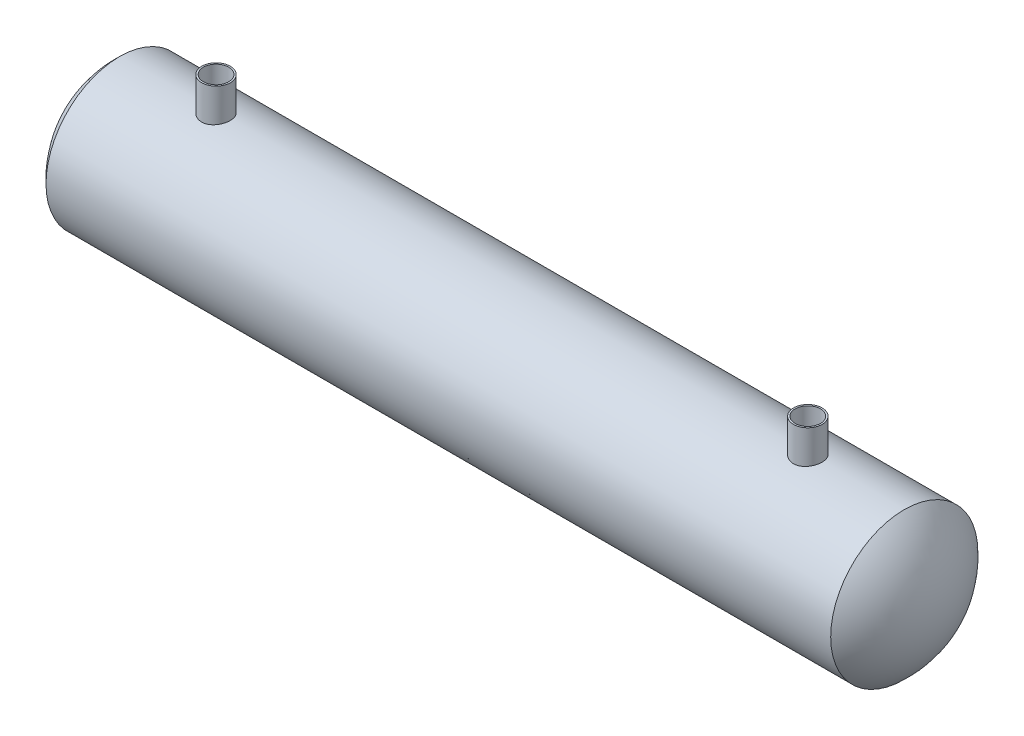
ISO-10303-21;
HEADER;
FILE_DESCRIPTION(('STEP AP214'),'2;1');
FILE_NAME('part.step','',(''),(''),'','','');
FILE_SCHEMA(('AUTOMOTIVE_DESIGN { 1 0 10303 214 1 1 1 1 }'));
ENDSEC;
DATA;
#1=APPLICATION_CONTEXT('core data for automotive mechanical design processes');
#2=APPLICATION_PROTOCOL_DEFINITION('international standard','automotive_design',2000,#1);
#3=PRODUCT_CONTEXT('',#1,'mechanical');
#4=PRODUCT('Part','Part','',(#3));
#5=PRODUCT_RELATED_PRODUCT_CATEGORY('part','',(#4));
#6=PRODUCT_DEFINITION_FORMATION('','',#4);
#7=PRODUCT_DEFINITION_CONTEXT('part definition',#1,'design');
#8=PRODUCT_DEFINITION('design','',#6,#7);
#9=PRODUCT_DEFINITION_SHAPE('','',#8);
#10=(LENGTH_UNIT() NAMED_UNIT(*) SI_UNIT(.MILLI.,.METRE.));
#11=(NAMED_UNIT(*) PLANE_ANGLE_UNIT() SI_UNIT($,.RADIAN.));
#12=(NAMED_UNIT(*) SI_UNIT($,.STERADIAN.) SOLID_ANGLE_UNIT());
#13=UNCERTAINTY_MEASURE_WITH_UNIT(LENGTH_MEASURE(1.E-05),#10,'distance_accuracy_value','');
#14=(GEOMETRIC_REPRESENTATION_CONTEXT(3) GLOBAL_UNCERTAINTY_ASSIGNED_CONTEXT((#13)) GLOBAL_UNIT_ASSIGNED_CONTEXT((#10,
#11,#12)) REPRESENTATION_CONTEXT('',''));
#15=CARTESIAN_POINT('',(0.,0.,0.));
#16=DIRECTION('',(0.,0.,1.));
#17=DIRECTION('',(1.,0.,0.));
#18=AXIS2_PLACEMENT_3D('',#15,#16,#17);
#19=CARTESIAN_POINT('',(-104.846097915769,0.,0.));
#20=DIRECTION('',(-1.,0.,0.));
#21=DIRECTION('',(0.,0.,1.));
#22=AXIS2_PLACEMENT_3D('',#19,#20,#21);
#23=CYLINDRICAL_SURFACE('',#22,87.);
#24=CARTESIAN_POINT('',(777.153902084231,85.221769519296,-17.4999999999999));
#25=CARTESIAN_POINT('',(777.64008679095,85.221770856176,-17.4999973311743));
#26=CARTESIAN_POINT('',(778.126331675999,85.2259413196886,-17.4797218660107));
#27=CARTESIAN_POINT('',(779.095353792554,85.2425035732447,-17.398771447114));
#28=CARTESIAN_POINT('',(779.578130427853,85.2548967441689,-17.3380897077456));
#29=CARTESIAN_POINT('',(780.53705160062,85.287548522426,-17.1767529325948));
#30=CARTESIAN_POINT('',(781.013191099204,85.3078128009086,-17.0760690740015));
#31=CARTESIAN_POINT('',(781.955069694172,85.3556089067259,-16.8355291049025));
#32=CARTESIAN_POINT('',(782.420809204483,85.3831404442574,-16.6956745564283));
#33=CARTESIAN_POINT('',(783.33819822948,85.4446384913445,-16.3780301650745));
#34=CARTESIAN_POINT('',(783.789861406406,85.4785985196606,-16.2002785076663));
#35=CARTESIAN_POINT('',(784.676501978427,85.5519975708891,-15.8080829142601));
#36=CARTESIAN_POINT('',(785.111479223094,85.5914366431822,-15.5936386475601));
#37=CARTESIAN_POINT('',(785.961791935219,85.6746746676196,-15.1296280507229));
#38=CARTESIAN_POINT('',(786.377128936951,85.718473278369,-14.8800644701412));
#39=CARTESIAN_POINT('',(787.185453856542,85.8092110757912,-14.3475508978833));
#40=CARTESIAN_POINT('',(787.578441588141,85.8561502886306,-14.0646006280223));
#41=CARTESIAN_POINT('',(788.344379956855,85.9524902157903,-13.4634044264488));
#42=CARTESIAN_POINT('',(788.717008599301,86.0019147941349,-13.1447520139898));
#43=CARTESIAN_POINT('',(789.43419404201,86.1012741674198,-12.4773546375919));
#44=CARTESIAN_POINT('',(789.778750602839,86.1512089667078,-12.1286094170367));
#45=CARTESIAN_POINT('',(790.437481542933,86.2502023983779,-11.4033552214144));
#46=CARTESIAN_POINT('',(790.751653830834,86.2992609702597,-11.0268443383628));
#47=CARTESIAN_POINT('',(791.347427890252,86.3951370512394,-10.2486084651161));
#48=CARTESIAN_POINT('',(791.62902957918,86.4419545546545,-9.84688341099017));
#49=CARTESIAN_POINT('',(792.160019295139,86.5324475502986,-9.01726855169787));
#50=CARTESIAN_POINT('',(792.40910033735,86.5760915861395,-8.5891787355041));
#51=CARTESIAN_POINT('',(792.87025763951,86.6585387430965,-7.71305591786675));
#52=CARTESIAN_POINT('',(793.082333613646,86.697341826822,-7.26502276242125));
#53=CARTESIAN_POINT('',(793.467850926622,86.7689981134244,-6.35220558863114));
#54=CARTESIAN_POINT('',(793.641295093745,86.8018517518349,-5.88742279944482));
#55=CARTESIAN_POINT('',(793.948204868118,86.8606694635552,-4.94441569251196));
#56=CARTESIAN_POINT('',(794.081671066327,86.8866336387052,-4.46619157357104));
#57=CARTESIAN_POINT('',(794.306045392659,86.9306279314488,-3.50623728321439));
#58=CARTESIAN_POINT('',(794.397496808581,86.9487591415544,-3.02463869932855));
#59=CARTESIAN_POINT('',(794.539700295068,86.9770723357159,-2.05523776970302));
#60=CARTESIAN_POINT('',(794.590452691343,86.987254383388,-1.56743547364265));
#61=CARTESIAN_POINT('',(794.650842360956,86.9993795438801,-0.589232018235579));
#62=CARTESIAN_POINT('',(794.660483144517,87.001323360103,-0.0988310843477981));
#63=CARTESIAN_POINT('',(794.638579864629,86.9969185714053,0.881010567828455));
#64=CARTESIAN_POINT('',(794.607036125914,86.9905700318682,1.3704512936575));
#65=CARTESIAN_POINT('',(794.503774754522,86.9699119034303,2.33775224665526));
#66=CARTESIAN_POINT('',(794.432643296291,86.9557184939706,2.81567767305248));
#67=CARTESIAN_POINT('',(794.251188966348,86.9198442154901,3.76373662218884));
#68=CARTESIAN_POINT('',(794.140866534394,86.8981634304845,4.23387023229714));
#69=CARTESIAN_POINT('',(793.88187830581,86.8479076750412,5.16308541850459));
#70=CARTESIAN_POINT('',(793.733211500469,86.8193325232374,5.62216670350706));
#71=CARTESIAN_POINT('',(793.398654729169,86.7560662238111,6.52612329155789));
#72=CARTESIAN_POINT('',(793.212764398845,86.7213750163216,6.9709984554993));
#73=CARTESIAN_POINT('',(792.803825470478,86.6465778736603,7.84631974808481));
#74=CARTESIAN_POINT('',(792.580548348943,86.6064389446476,8.27665627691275));
#75=CARTESIAN_POINT('',(792.099279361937,86.5220099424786,9.11702608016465));
#76=CARTESIAN_POINT('',(791.841287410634,86.4777198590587,9.52705930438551));
#77=CARTESIAN_POINT('',(791.292361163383,86.3861841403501,10.3241546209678));
#78=CARTESIAN_POINT('',(791.00142365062,86.3389382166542,10.711214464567));
#79=CARTESIAN_POINT('',(790.388602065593,86.242772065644,11.4597863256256));
#80=CARTESIAN_POINT('',(790.066717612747,86.1938518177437,11.8212980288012));
#81=CARTESIAN_POINT('',(789.388205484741,86.0947942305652,12.5225406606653));
#82=CARTESIAN_POINT('',(789.031064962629,86.0446506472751,12.8617746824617));
#83=CARTESIAN_POINT('',(788.28938137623,85.9454121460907,13.5090102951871));
#84=CARTESIAN_POINT('',(787.904837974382,85.896317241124,13.8170115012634));
#85=CARTESIAN_POINT('',(787.110945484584,85.800568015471,14.399643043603));
#86=CARTESIAN_POINT('',(786.701595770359,85.753913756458,14.6742725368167));
#87=CARTESIAN_POINT('',(785.860887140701,85.6643854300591,15.1881905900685));
#88=CARTESIAN_POINT('',(785.429528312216,85.6215113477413,15.4274792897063));
#89=CARTESIAN_POINT('',(784.546795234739,85.5406997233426,15.8694455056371));
#90=CARTESIAN_POINT('',(784.095378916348,85.5027732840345,16.0720410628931));
#91=CARTESIAN_POINT('',(783.176594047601,85.4330909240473,16.4384238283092));
#92=CARTESIAN_POINT('',(782.709225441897,85.40133502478,16.6022109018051));
#93=CARTESIAN_POINT('',(781.761941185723,85.344950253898,16.8896696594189));
#94=CARTESIAN_POINT('',(781.282026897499,85.3203206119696,17.0133456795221));
#95=CARTESIAN_POINT('',(780.313114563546,85.2789328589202,17.21960212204));
#96=CARTESIAN_POINT('',(779.824116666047,85.2621746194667,17.3021832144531));
#97=CARTESIAN_POINT('',(778.849184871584,85.2372608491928,17.4244996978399));
#98=CARTESIAN_POINT('',(778.363344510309,85.2289613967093,17.464952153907));
#99=CARTESIAN_POINT('',(777.38991411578,85.2207066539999,17.5051874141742));
#100=CARTESIAN_POINT('',(776.902324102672,85.2207512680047,17.5049706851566));
#101=CARTESIAN_POINT('',(775.928961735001,85.2291830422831,17.4638710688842));
#102=CARTESIAN_POINT('',(775.443189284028,85.2375697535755,17.42299037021));
#103=CARTESIAN_POINT('',(774.476951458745,85.2624349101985,17.3008978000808));
#104=CARTESIAN_POINT('',(773.996486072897,85.2789133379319,17.2196860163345));
#105=CARTESIAN_POINT('',(773.04894948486,85.3192753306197,17.0185678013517));
#106=CARTESIAN_POINT('',(772.581793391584,85.3430851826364,16.8990460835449));
#107=CARTESIAN_POINT('',(771.65929817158,85.3974744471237,16.6220114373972));
#108=CARTESIAN_POINT('',(771.203958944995,85.4280538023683,16.4644988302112));
#109=CARTESIAN_POINT('',(770.30816015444,85.495114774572,16.1126472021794));
#110=CARTESIAN_POINT('',(769.867701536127,85.5315967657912,15.9183058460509));
#111=CARTESIAN_POINT('',(769.00462664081,85.6094384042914,15.4942088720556));
#112=CARTESIAN_POINT('',(768.582010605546,85.6507981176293,15.2644527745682));
#113=CARTESIAN_POINT('',(767.751960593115,85.7378206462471,14.7678859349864));
#114=CARTESIAN_POINT('',(767.344799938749,85.7835329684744,14.5006269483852));
#115=CARTESIAN_POINT('',(766.554350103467,85.8775085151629,13.9332759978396));
#116=CARTESIAN_POINT('',(766.171061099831,85.9257717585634,13.6331837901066));
#117=CARTESIAN_POINT('',(765.430856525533,86.0235151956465,13.00218210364));
#118=CARTESIAN_POINT('',(765.073943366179,86.0729955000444,12.6712698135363));
#119=CARTESIAN_POINT('',(764.38889637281,86.1718077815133,11.9808648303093));
#120=CARTESIAN_POINT('',(764.060762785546,86.2211397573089,11.6213718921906));
#121=CARTESIAN_POINT('',(763.430609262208,86.3190613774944,10.8703827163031));
#122=CARTESIAN_POINT('',(763.129075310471,86.3676275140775,10.478475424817));
#123=CARTESIAN_POINT('',(762.560093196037,86.4618442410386,9.67031344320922));
#124=CARTESIAN_POINT('',(762.292645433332,86.5074947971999,9.25405846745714));
#125=CARTESIAN_POINT('',(761.793784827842,86.5945890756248,8.40007870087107));
#126=CARTESIAN_POINT('',(761.562370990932,86.6360329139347,7.96235450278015));
#127=CARTESIAN_POINT('',(761.137302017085,86.7135386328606,7.06848195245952));
#128=CARTESIAN_POINT('',(760.943646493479,86.7496005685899,6.61233378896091));
#129=CARTESIAN_POINT('',(760.596594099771,86.8151228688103,5.68753554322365));
#130=CARTESIAN_POINT('',(760.442970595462,86.8446202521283,5.21897315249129));
#131=CARTESIAN_POINT('',(760.175726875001,86.8964396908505,4.27018328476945));
#132=CARTESIAN_POINT('',(760.062106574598,86.9187617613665,3.78995583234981));
#133=CARTESIAN_POINT('',(759.875794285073,86.9555901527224,2.82137887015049));
#134=CARTESIAN_POINT('',(759.803098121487,86.9700972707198,2.33303019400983));
#135=CARTESIAN_POINT('',(759.699213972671,86.9908819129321,1.35176579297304));
#136=CARTESIAN_POINT('',(759.668025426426,86.9971595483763,0.858850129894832));
#137=CARTESIAN_POINT('',(759.64759425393,87.0012685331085,-0.119188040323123));
#138=CARTESIAN_POINT('',(759.657622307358,86.9992467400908,-0.604294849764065));
#139=CARTESIAN_POINT('',(759.717901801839,86.9871440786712,-1.57189674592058));
#140=CARTESIAN_POINT('',(759.76815273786,86.9770633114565,-2.05439186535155));
#141=CARTESIAN_POINT('',(759.908475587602,86.9491231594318,-3.01331567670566));
#142=CARTESIAN_POINT('',(759.998546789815,86.9312639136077,-3.48974447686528));
#143=CARTESIAN_POINT('',(760.2178024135,86.8882611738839,-4.43317786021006));
#144=CARTESIAN_POINT('',(760.346986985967,86.8631176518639,-4.90018240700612));
#145=CARTESIAN_POINT('',(760.643127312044,86.8063052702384,-5.82043058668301));
#146=CARTESIAN_POINT('',(760.809993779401,86.7746518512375,-6.27370392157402));
#147=CARTESIAN_POINT('',(761.180422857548,86.7056454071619,-7.16454236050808));
#148=CARTESIAN_POINT('',(761.383985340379,86.6682924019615,-7.60210751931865));
#149=CARTESIAN_POINT('',(761.826348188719,86.5888941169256,-8.45863093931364));
#150=CARTESIAN_POINT('',(762.065150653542,86.5468485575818,-8.87758809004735));
#151=CARTESIAN_POINT('',(762.576310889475,86.4591972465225,-9.69411391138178));
#152=CARTESIAN_POINT('',(762.848669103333,86.4135914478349,-10.0916822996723));
#153=CARTESIAN_POINT('',(763.429788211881,86.319278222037,-10.8691329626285));
#154=CARTESIAN_POINT('',(763.739070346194,86.2705323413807,-11.2486210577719));
#155=CARTESIAN_POINT('',(764.388252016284,86.1719729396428,-11.9802913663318));
#156=CARTESIAN_POINT('',(764.728151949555,86.1221594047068,-12.3324732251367));
#157=CARTESIAN_POINT('',(765.436354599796,86.0228341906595,-13.0072422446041));
#158=CARTESIAN_POINT('',(765.804663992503,85.9733225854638,-13.3298224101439));
#159=CARTESIAN_POINT('',(766.56714348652,85.8759949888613,-13.9430954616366));
#160=CARTESIAN_POINT('',(766.961313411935,85.8281789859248,-14.2337885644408));
#161=CARTESIAN_POINT('',(767.777315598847,85.7350822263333,-14.7842646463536));
#162=CARTESIAN_POINT('',(768.199403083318,85.6898348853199,-15.0436751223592));
#163=CARTESIAN_POINT('',(769.064424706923,85.603764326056,-15.525964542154));
#164=CARTESIAN_POINT('',(769.507359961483,85.5629413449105,-15.748841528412));
#165=CARTESIAN_POINT('',(770.410572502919,85.4869589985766,-16.1561987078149));
#166=CARTESIAN_POINT('',(770.870835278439,85.4517950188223,-16.3407102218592));
#167=CARTESIAN_POINT('',(771.805720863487,85.3881474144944,-16.6701072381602));
#168=CARTESIAN_POINT('',(772.280340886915,85.3596625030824,-16.8150003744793));
#169=CARTESIAN_POINT('',(773.118311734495,85.3165169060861,-17.0323463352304));
#170=CARTESIAN_POINT('',(773.479258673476,85.3001828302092,-17.1138506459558));
#171=CARTESIAN_POINT('',(774.205843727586,85.2719725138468,-17.253864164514));
#172=CARTESIAN_POINT('',(774.571482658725,85.2600970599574,-17.3123693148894));
#173=CARTESIAN_POINT('',(775.305845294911,85.241014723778,-17.40608227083));
#174=CARTESIAN_POINT('',(775.67456891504,85.2338077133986,-17.4412907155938));
#175=CARTESIAN_POINT('',(776.413484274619,85.2241850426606,-17.4882484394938));
#176=CARTESIAN_POINT('',(776.783675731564,85.2217685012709,-17.5000020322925));
#177=CARTESIAN_POINT('',(777.153902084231,85.221769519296,-17.4999999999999));
#178=B_SPLINE_CURVE_WITH_KNOTS('',3,(#24,#25,#26,#27,#28,#29,#30,#31,#32,#33,#34,#35,#36,#37,
#38,#39,#40,#41,#42,#43,#44,#45,#46,#47,#48,#49,#50,#51,#52,#53,#54,#55,#56,#57,#58,#59,#60,#61,
#62,#63,#64,#65,#66,#67,#68,#69,#70,#71,#72,#73,#74,#75,#76,#77,#78,#79,#80,#81,#82,#83,#84,#85,
#86,#87,#88,#89,#90,#91,#92,#93,#94,#95,#96,#97,#98,#99,#100,#101,#102,#103,#104,#105,#106,#107,
#108,#109,#110,#111,#112,#113,#114,#115,#116,#117,#118,#119,#120,#121,#122,#123,#124,#125,#126,
#127,#128,#129,#130,#131,#132,#133,#134,#135,#136,#137,#138,#139,#140,#141,#142,#143,#144,#145,
#146,#147,#148,#149,#150,#151,#152,#153,#154,#155,#156,#157,#158,#159,#160,#161,#162,#163,#164,
#165,#166,#167,#168,#169,#170,#171,#172,#173,#174,#175,#176,#177),.UNSPECIFIED.,.T.,.F.,(4,2,2,
2,2,2,2,2,2,2,2,2,2,2,2,2,2,2,2,2,2,2,2,2,2,2,2,2,2,2,2,2,2,2,2,2,2,2,2,2,2,2,2,2,2,2,2,2,2,2,2,
2,2,2,2,2,2,2,2,2,2,2,2,2,2,2,2,2,2,2,2,2,2,2,2,2,4),(0.,1.45821915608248,2.91668326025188,
4.37620014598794,5.83565883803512,7.29365385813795,8.75166201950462,10.2095560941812,
11.6674623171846,13.1440845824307,14.6207194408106,16.0974558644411,17.5741960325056,
19.0639989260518,20.5538133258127,22.0435186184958,23.5332018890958,25.0030389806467,
26.4728643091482,27.9425641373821,29.4122523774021,30.8607367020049,32.3092047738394,
33.7577109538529,35.2062313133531,36.6639524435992,38.1216771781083,39.5795443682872,
41.0374294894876,42.5210402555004,44.0046693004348,45.4883358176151,46.9719964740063,
48.458931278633,49.9458712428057,51.4326504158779,52.9194053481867,54.3804189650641,
55.8414158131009,57.3023340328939,58.7632490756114,60.2099303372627,61.6565993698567,
63.1033601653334,64.5501405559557,66.0159790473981,67.4818284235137,68.9478116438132,
70.4138074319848,71.9026226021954,73.3914552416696,74.8802467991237,76.3690231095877,
77.8491782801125,79.3293303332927,80.8093313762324,82.2893124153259,83.743219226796,
85.1971077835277,86.6509703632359,88.1048385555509,89.5552973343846,91.0057510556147,
92.456291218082,93.9068505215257,95.3810665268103,96.8553016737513,98.3298843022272,
99.8044569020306,101.295143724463,102.785910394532,104.275455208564,105.764712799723,
106.875175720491,107.98583445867,109.096462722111,110.206886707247),.UNSPECIFIED.);
#179=CARTESIAN_POINT('',(777.153902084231,85.221769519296,-17.4999999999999));
#180=VERTEX_POINT('',#179);
#181=EDGE_CURVE('E43',#180,#180,#178,.T.);
#182=ORIENTED_EDGE('',*,*,#181,.F.);
#183=EDGE_LOOP('',(#182));
#184=FACE_BOUND('',#183,.T.);
#185=CARTESIAN_POINT('',(895.153902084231,0.,0.));
#186=DIRECTION('',(-1.,0.,0.));
#187=DIRECTION('',(0.,0.,1.));
#188=AXIS2_PLACEMENT_3D('',#185,#186,#187);
#189=CIRCLE('',#188,87.);
#190=CARTESIAN_POINT('',(895.153902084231,0.,87.));
#191=VERTEX_POINT('',#190);
#192=EDGE_CURVE('E99',#191,#191,#189,.T.);
#193=ORIENTED_EDGE('',*,*,#192,.F.);
#194=EDGE_LOOP('',(#193));
#195=FACE_BOUND('',#194,.T.);
#196=CARTESIAN_POINT('',(-64.8460979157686,0.,0.));
#197=DIRECTION('',(-1.,0.,0.));
#198=DIRECTION('',(0.,0.,1.));
#199=AXIS2_PLACEMENT_3D('',#196,#197,#198);
#200=CIRCLE('',#199,87.);
#201=CARTESIAN_POINT('',(-64.8460979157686,0.,87.));
#202=VERTEX_POINT('',#201);
#203=EDGE_CURVE('E96',#202,#202,#200,.T.);
#204=ORIENTED_EDGE('',*,*,#203,.T.);
#205=EDGE_LOOP('',(#204));
#206=FACE_BOUND('',#205,.T.);
#207=CARTESIAN_POINT('',(53.1539020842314,85.221769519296,-17.5));
#208=CARTESIAN_POINT('',(53.6400867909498,85.221770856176,-17.4999973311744));
#209=CARTESIAN_POINT('',(54.1263316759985,85.2259413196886,-17.4797218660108));
#210=CARTESIAN_POINT('',(55.0953537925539,85.2425035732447,-17.398771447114));
#211=CARTESIAN_POINT('',(55.5781304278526,85.2548967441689,-17.3380897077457));
#212=CARTESIAN_POINT('',(56.5370516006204,85.287548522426,-17.1767529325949));
#213=CARTESIAN_POINT('',(57.0131910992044,85.3078128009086,-17.0760690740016));
#214=CARTESIAN_POINT('',(57.9550696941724,85.3556089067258,-16.8355291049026));
#215=CARTESIAN_POINT('',(58.420809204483,85.3831404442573,-16.6956745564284));
#216=CARTESIAN_POINT('',(59.33819822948,85.4446384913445,-16.3780301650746));
#217=CARTESIAN_POINT('',(59.7898614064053,85.4785985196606,-16.2002785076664));
#218=CARTESIAN_POINT('',(60.676501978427,85.551997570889,-15.8080829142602));
#219=CARTESIAN_POINT('',(61.1114792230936,85.5914366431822,-15.5936386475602));
#220=CARTESIAN_POINT('',(61.9617919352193,85.6746746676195,-15.129628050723));
#221=CARTESIAN_POINT('',(62.3771289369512,85.718473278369,-14.8800644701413));
#222=CARTESIAN_POINT('',(63.1854538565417,85.8092110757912,-14.3475508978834));
#223=CARTESIAN_POINT('',(63.5784415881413,85.8561502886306,-14.0646006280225));
#224=CARTESIAN_POINT('',(64.3443799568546,85.9524902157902,-13.463404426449));
#225=CARTESIAN_POINT('',(64.7170085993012,86.0019147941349,-13.14475201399));
#226=CARTESIAN_POINT('',(65.4341940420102,86.1012741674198,-12.477354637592));
#227=CARTESIAN_POINT('',(65.7787506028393,86.1512089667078,-12.1286094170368));
#228=CARTESIAN_POINT('',(66.4374815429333,86.2502023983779,-11.4033552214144));
#229=CARTESIAN_POINT('',(66.7516538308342,86.2992609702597,-11.0268443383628));
#230=CARTESIAN_POINT('',(67.3474278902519,86.3951370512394,-10.2486084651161));
#231=CARTESIAN_POINT('',(67.6290295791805,86.4419545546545,-9.84688341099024));
#232=CARTESIAN_POINT('',(68.1600192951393,86.5324475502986,-9.01726855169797));
#233=CARTESIAN_POINT('',(68.4091003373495,86.5760915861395,-8.58917873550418));
#234=CARTESIAN_POINT('',(68.8702576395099,86.6585387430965,-7.71305591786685));
#235=CARTESIAN_POINT('',(69.0823336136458,86.697341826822,-7.26502276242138));
#236=CARTESIAN_POINT('',(69.4678509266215,86.7689981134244,-6.35220558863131));
#237=CARTESIAN_POINT('',(69.6412950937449,86.8018517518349,-5.887422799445));
#238=CARTESIAN_POINT('',(69.9482048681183,86.8606694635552,-4.94441569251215));
#239=CARTESIAN_POINT('',(70.0816710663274,86.8866336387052,-4.46619157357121));
#240=CARTESIAN_POINT('',(70.3060453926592,86.9306279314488,-3.50623728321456));
#241=CARTESIAN_POINT('',(70.3974968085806,86.9487591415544,-3.02463869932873));
#242=CARTESIAN_POINT('',(70.539700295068,86.9770723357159,-2.0552377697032));
#243=CARTESIAN_POINT('',(70.5904526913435,86.987254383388,-1.56743547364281));
#244=CARTESIAN_POINT('',(70.6508423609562,86.9993795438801,-0.589232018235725));
#245=CARTESIAN_POINT('',(70.6604831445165,87.001323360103,-0.0988310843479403));
#246=CARTESIAN_POINT('',(70.6385798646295,86.9969185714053,0.881010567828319));
#247=CARTESIAN_POINT('',(70.6070361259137,86.9905700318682,1.37045129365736));
#248=CARTESIAN_POINT('',(70.5037747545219,86.9699119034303,2.33775224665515));
#249=CARTESIAN_POINT('',(70.4326432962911,86.9557184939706,2.81567767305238));
#250=CARTESIAN_POINT('',(70.2511889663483,86.9198442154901,3.76373662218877));
#251=CARTESIAN_POINT('',(70.1408665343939,86.8981634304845,4.23387023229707));
#252=CARTESIAN_POINT('',(69.8818783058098,86.8479076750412,5.16308541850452));
#253=CARTESIAN_POINT('',(69.7332115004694,86.8193325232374,5.62216670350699));
#254=CARTESIAN_POINT('',(69.3986547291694,86.7560662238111,6.52612329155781));
#255=CARTESIAN_POINT('',(69.2127643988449,86.7213750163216,6.97099845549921));
#256=CARTESIAN_POINT('',(68.8038254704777,86.6465778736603,7.84631974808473));
#257=CARTESIAN_POINT('',(68.5805483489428,86.6064389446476,8.2766562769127));
#258=CARTESIAN_POINT('',(68.0992793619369,86.5220099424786,9.11702608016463));
#259=CARTESIAN_POINT('',(67.841287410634,86.4777198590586,9.52705930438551));
#260=CARTESIAN_POINT('',(67.2923611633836,86.3861841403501,10.3241546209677));
#261=CARTESIAN_POINT('',(67.0014236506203,86.3389382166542,10.711214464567));
#262=CARTESIAN_POINT('',(66.3886020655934,86.242772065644,11.4597863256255));
#263=CARTESIAN_POINT('',(66.0667176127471,86.1938518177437,11.8212980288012));
#264=CARTESIAN_POINT('',(65.3882054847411,86.0947942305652,12.5225406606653));
#265=CARTESIAN_POINT('',(65.0310649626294,86.0446506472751,12.8617746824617));
#266=CARTESIAN_POINT('',(64.2893813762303,85.9454121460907,13.509010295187));
#267=CARTESIAN_POINT('',(63.9048379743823,85.896317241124,13.8170115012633));
#268=CARTESIAN_POINT('',(63.1109454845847,85.800568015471,14.3996430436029));
#269=CARTESIAN_POINT('',(62.7015957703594,85.7539137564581,14.6742725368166));
#270=CARTESIAN_POINT('',(61.8608871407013,85.6643854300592,15.1881905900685));
#271=CARTESIAN_POINT('',(61.4295283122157,85.6215113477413,15.4274792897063));
#272=CARTESIAN_POINT('',(60.5467952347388,85.5406997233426,15.8694455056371));
#273=CARTESIAN_POINT('',(60.0953789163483,85.5027732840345,16.0720410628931));
#274=CARTESIAN_POINT('',(59.1765940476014,85.4330909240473,16.4384238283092));
#275=CARTESIAN_POINT('',(58.7092254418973,85.40133502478,16.6022109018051));
#276=CARTESIAN_POINT('',(57.7619411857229,85.344950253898,16.8896696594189));
#277=CARTESIAN_POINT('',(57.2820268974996,85.3203206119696,17.0133456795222));
#278=CARTESIAN_POINT('',(56.3131145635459,85.2789328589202,17.2196021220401));
#279=CARTESIAN_POINT('',(55.8241166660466,85.2621746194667,17.3021832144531));
#280=CARTESIAN_POINT('',(54.8491848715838,85.2372608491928,17.42449969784));
#281=CARTESIAN_POINT('',(54.363344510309,85.2289613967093,17.464952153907));
#282=CARTESIAN_POINT('',(53.3899141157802,85.2207066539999,17.5051874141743));
#283=CARTESIAN_POINT('',(52.9023241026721,85.2207512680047,17.5049706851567));
#284=CARTESIAN_POINT('',(51.9289617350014,85.2291830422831,17.4638710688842));
#285=CARTESIAN_POINT('',(51.4431892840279,85.2375697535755,17.4229903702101));
#286=CARTESIAN_POINT('',(50.4769514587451,85.2624349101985,17.3008978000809));
#287=CARTESIAN_POINT('',(49.9964860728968,85.2789133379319,17.2196860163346));
#288=CARTESIAN_POINT('',(49.0489494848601,85.3192753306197,17.0185678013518));
#289=CARTESIAN_POINT('',(48.5817933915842,85.3430851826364,16.8990460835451));
#290=CARTESIAN_POINT('',(47.6592981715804,85.3974744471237,16.6220114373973));
#291=CARTESIAN_POINT('',(47.203958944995,85.4280538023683,16.4644988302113));
#292=CARTESIAN_POINT('',(46.3081601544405,85.4951147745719,16.1126472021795));
#293=CARTESIAN_POINT('',(45.8677015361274,85.5315967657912,15.9183058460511));
#294=CARTESIAN_POINT('',(45.0046266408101,85.6094384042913,15.4942088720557));
#295=CARTESIAN_POINT('',(44.5820106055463,85.6507981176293,15.2644527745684));
#296=CARTESIAN_POINT('',(43.7519605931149,85.7378206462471,14.7678859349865));
#297=CARTESIAN_POINT('',(43.3447999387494,85.7835329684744,14.5006269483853));
#298=CARTESIAN_POINT('',(42.5543501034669,85.8775085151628,13.9332759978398));
#299=CARTESIAN_POINT('',(42.1710610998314,85.9257717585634,13.6331837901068));
#300=CARTESIAN_POINT('',(41.4308565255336,86.0235151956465,13.0021821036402));
#301=CARTESIAN_POINT('',(41.0739433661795,86.0729955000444,12.6712698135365));
#302=CARTESIAN_POINT('',(40.3888963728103,86.1718077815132,11.9808648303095));
#303=CARTESIAN_POINT('',(40.0607627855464,86.2211397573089,11.6213718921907));
#304=CARTESIAN_POINT('',(39.4306092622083,86.3190613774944,10.8703827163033));
#305=CARTESIAN_POINT('',(39.129075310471,86.3676275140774,10.4784754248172));
#306=CARTESIAN_POINT('',(38.5600931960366,86.4618442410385,9.67031344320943));
#307=CARTESIAN_POINT('',(38.2926454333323,86.5074947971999,9.25405846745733));
#308=CARTESIAN_POINT('',(37.7937848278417,86.5945890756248,8.40007870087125));
#309=CARTESIAN_POINT('',(37.5623709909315,86.6360329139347,7.96235450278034));
#310=CARTESIAN_POINT('',(37.137302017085,86.7135386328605,7.06848195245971));
#311=CARTESIAN_POINT('',(36.9436464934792,86.7496005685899,6.61233378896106));
#312=CARTESIAN_POINT('',(36.5965940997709,86.8151228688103,5.68753554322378));
#313=CARTESIAN_POINT('',(36.4429705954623,86.8446202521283,5.21897315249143));
#314=CARTESIAN_POINT('',(36.1757268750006,86.8964396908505,4.2701832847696));
#315=CARTESIAN_POINT('',(36.0621065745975,86.9187617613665,3.78995583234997));
#316=CARTESIAN_POINT('',(35.8757942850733,86.9555901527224,2.82137887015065));
#317=CARTESIAN_POINT('',(35.8030981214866,86.9700972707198,2.33303019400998));
#318=CARTESIAN_POINT('',(35.6992139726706,86.9908819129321,1.35176579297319));
#319=CARTESIAN_POINT('',(35.6680254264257,86.9971595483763,0.858850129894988));
#320=CARTESIAN_POINT('',(35.6475942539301,87.0012685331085,-0.119188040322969));
#321=CARTESIAN_POINT('',(35.6576223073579,86.9992467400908,-0.604294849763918));
#322=CARTESIAN_POINT('',(35.7179018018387,86.9871440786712,-1.57189674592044));
#323=CARTESIAN_POINT('',(35.7681527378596,86.9770633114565,-2.0543918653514));
#324=CARTESIAN_POINT('',(35.9084755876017,86.9491231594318,-3.01331567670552));
#325=CARTESIAN_POINT('',(35.9985467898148,86.9312639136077,-3.48974447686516));
#326=CARTESIAN_POINT('',(36.2178024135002,86.8882611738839,-4.43317786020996));
#327=CARTESIAN_POINT('',(36.346986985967,86.8631176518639,-4.90018240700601));
#328=CARTESIAN_POINT('',(36.6431273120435,86.8063052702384,-5.82043058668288));
#329=CARTESIAN_POINT('',(36.8099937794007,86.7746518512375,-6.27370392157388));
#330=CARTESIAN_POINT('',(37.1804228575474,86.7056454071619,-7.16454236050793));
#331=CARTESIAN_POINT('',(37.383985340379,86.6682924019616,-7.6021075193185));
#332=CARTESIAN_POINT('',(37.8263481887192,86.5888941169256,-8.45863093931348));
#333=CARTESIAN_POINT('',(38.0651506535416,86.5468485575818,-8.87758809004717));
#334=CARTESIAN_POINT('',(38.5763108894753,86.4591972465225,-9.69411391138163));
#335=CARTESIAN_POINT('',(38.8486691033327,86.4135914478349,-10.0916822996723));
#336=CARTESIAN_POINT('',(39.4297882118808,86.319278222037,-10.8691329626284));
#337=CARTESIAN_POINT('',(39.7390703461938,86.2705323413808,-11.2486210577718));
#338=CARTESIAN_POINT('',(40.3882520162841,86.1719729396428,-11.9802913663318));
#339=CARTESIAN_POINT('',(40.7281519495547,86.1221594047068,-12.3324732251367));
#340=CARTESIAN_POINT('',(41.436354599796,86.0228341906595,-13.0072422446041));
#341=CARTESIAN_POINT('',(41.8046639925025,85.9733225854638,-13.3298224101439));
#342=CARTESIAN_POINT('',(42.5671434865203,85.8759949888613,-13.9430954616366));
#343=CARTESIAN_POINT('',(42.9613134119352,85.8281789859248,-14.2337885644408));
#344=CARTESIAN_POINT('',(43.7773155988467,85.7350822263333,-14.7842646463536));
#345=CARTESIAN_POINT('',(44.1994030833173,85.6898348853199,-15.0436751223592));
#346=CARTESIAN_POINT('',(45.0644247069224,85.603764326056,-15.525964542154));
#347=CARTESIAN_POINT('',(45.5073599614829,85.5629413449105,-15.748841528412));
#348=CARTESIAN_POINT('',(46.4105725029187,85.4869589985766,-16.1561987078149));
#349=CARTESIAN_POINT('',(46.8708352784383,85.4517950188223,-16.3407102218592));
#350=CARTESIAN_POINT('',(47.8057208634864,85.3881474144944,-16.6701072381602));
#351=CARTESIAN_POINT('',(48.2803408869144,85.3596625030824,-16.8150003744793));
#352=CARTESIAN_POINT('',(49.1183117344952,85.3165169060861,-17.0323463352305));
#353=CARTESIAN_POINT('',(49.4792586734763,85.3001828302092,-17.1138506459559));
#354=CARTESIAN_POINT('',(50.2058437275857,85.2719725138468,-17.2538641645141));
#355=CARTESIAN_POINT('',(50.5714826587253,85.2600970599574,-17.3123693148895));
#356=CARTESIAN_POINT('',(51.3058452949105,85.241014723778,-17.4060822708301));
#357=CARTESIAN_POINT('',(51.6745689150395,85.2338077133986,-17.4412907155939));
#358=CARTESIAN_POINT('',(52.413484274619,85.2241850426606,-17.4882484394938));
#359=CARTESIAN_POINT('',(52.7836757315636,85.2217685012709,-17.5000020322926));
#360=CARTESIAN_POINT('',(53.1539020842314,85.221769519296,-17.5));
#361=B_SPLINE_CURVE_WITH_KNOTS('',3,(#207,#208,#209,#210,#211,#212,#213,#214,#215,#216,#217,
#218,#219,#220,#221,#222,#223,#224,#225,#226,#227,#228,#229,#230,#231,#232,#233,#234,#235,#236,
#237,#238,#239,#240,#241,#242,#243,#244,#245,#246,#247,#248,#249,#250,#251,#252,#253,#254,#255,
#256,#257,#258,#259,#260,#261,#262,#263,#264,#265,#266,#267,#268,#269,#270,#271,#272,#273,#274,
#275,#276,#277,#278,#279,#280,#281,#282,#283,#284,#285,#286,#287,#288,#289,#290,#291,#292,#293,
#294,#295,#296,#297,#298,#299,#300,#301,#302,#303,#304,#305,#306,#307,#308,#309,#310,#311,#312,
#313,#314,#315,#316,#317,#318,#319,#320,#321,#322,#323,#324,#325,#326,#327,#328,#329,#330,#331,
#332,#333,#334,#335,#336,#337,#338,#339,#340,#341,#342,#343,#344,#345,#346,#347,#348,#349,#350,
#351,#352,#353,#354,#355,#356,#357,#358,#359,#360),.UNSPECIFIED.,.T.,.F.,(4,2,2,2,2,2,2,2,2,2,2,
2,2,2,2,2,2,2,2,2,2,2,2,2,2,2,2,2,2,2,2,2,2,2,2,2,2,2,2,2,2,2,2,2,2,2,2,2,2,2,2,2,2,2,2,2,2,2,2,
2,2,2,2,2,2,2,2,2,2,2,2,2,2,2,2,2,4),(0.,1.45821915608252,2.91668326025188,4.37620014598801,
5.83565883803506,7.29365385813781,8.75166201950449,10.2095560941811,11.6674623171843,
13.1440845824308,14.6207194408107,16.0974558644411,17.5741960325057,19.0639989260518,
20.5538133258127,22.0435186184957,23.5332018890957,25.0030389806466,26.4728643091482,
27.9425641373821,29.4122523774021,30.8607367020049,32.3092047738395,33.7577109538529,
35.2062313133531,36.6639524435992,38.1216771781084,39.5795443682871,41.0374294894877,
42.5210402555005,44.0046693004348,45.4883358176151,46.9719964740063,48.4589312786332,
49.9458712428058,51.4326504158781,52.9194053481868,54.3804189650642,55.8414158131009,
57.302334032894,58.7632490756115,60.2099303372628,61.6565993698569,63.1033601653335,
64.5501405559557,66.0159790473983,67.4818284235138,68.9478116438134,70.4138074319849,
71.9026226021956,73.3914552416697,74.8802467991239,76.3690231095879,77.8491782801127,
79.329330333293,80.8093313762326,82.2893124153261,83.7432192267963,85.1971077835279,
86.6509703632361,88.1048385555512,89.5552973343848,91.005751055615,92.4562912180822,
93.906850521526,95.3810665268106,96.8553016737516,98.3298843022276,99.804456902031,
101.295143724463,102.785910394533,104.275455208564,105.764712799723,106.875175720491,
107.985834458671,109.096462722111,110.206886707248),.UNSPECIFIED.);
#362=CARTESIAN_POINT('',(53.1539020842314,85.221769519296,-17.5));
#363=VERTEX_POINT('',#362);
#364=EDGE_CURVE('E10',#363,#363,#361,.T.);
#365=ORIENTED_EDGE('',*,*,#364,.F.);
#366=EDGE_LOOP('',(#365));
#367=FACE_BOUND('',#366,.T.);
#368=ADVANCED_FACE('F28',(#184,#195,#206,#367),#23,.F.);
#369=CARTESIAN_POINT('',(-104.846097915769,0.,0.));
#370=DIRECTION('',(-1.,0.,0.));
#371=DIRECTION('',(0.,0.,1.));
#372=AXIS2_PLACEMENT_3D('',#369,#370,#371);
#373=CYLINDRICAL_SURFACE('',#372,90.);
#374=CARTESIAN_POINT('',(777.153902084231,88.2822179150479,-17.4999999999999));
#375=CARTESIAN_POINT('',(776.667361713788,88.2822192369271,-17.4999972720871));
#376=CARTESIAN_POINT('',(776.180758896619,88.2862509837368,-17.4796921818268));
#377=CARTESIAN_POINT('',(775.211017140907,88.3022628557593,-17.3986217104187));
#378=CARTESIAN_POINT('',(774.727878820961,88.3142443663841,-17.3378492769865));
#379=CARTESIAN_POINT('',(773.76821981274,88.3458131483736,-17.1762649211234));
#380=CARTESIAN_POINT('',(773.29170433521,88.3654060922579,-17.0754231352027));
#381=CARTESIAN_POINT('',(772.349076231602,88.4116209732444,-16.8344972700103));
#382=CARTESIAN_POINT('',(771.882963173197,88.4382426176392,-16.6944148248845));
#383=CARTESIAN_POINT('',(770.964818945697,88.4977121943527,-16.3762352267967));
#384=CARTESIAN_POINT('',(770.512774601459,88.5305540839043,-16.1981749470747));
#385=CARTESIAN_POINT('',(769.625391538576,88.6015396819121,-15.8052835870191));
#386=CARTESIAN_POINT('',(769.190052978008,88.639683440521,-15.5904521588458));
#387=CARTESIAN_POINT('',(768.339056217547,88.7201897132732,-15.1255924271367));
#388=CARTESIAN_POINT('',(767.923396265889,88.7625518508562,-14.8755672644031));
#389=CARTESIAN_POINT('',(767.1144746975,88.8503145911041,-14.3420588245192));
#390=CARTESIAN_POINT('',(766.721213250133,88.8957152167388,-14.0585752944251));
#391=CARTESIAN_POINT('',(765.955109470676,88.9888568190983,-13.4564941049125));
#392=CARTESIAN_POINT('',(765.582568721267,89.0366193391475,-13.1375159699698));
#393=CARTESIAN_POINT('',(764.865592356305,89.132633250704,-12.4694641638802));
#394=CARTESIAN_POINT('',(764.521156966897,89.1808846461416,-12.1203902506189));
#395=CARTESIAN_POINT('',(763.862709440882,89.2765347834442,-11.3944869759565));
#396=CARTESIAN_POINT('',(763.54869932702,89.3239334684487,-11.0176557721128));
#397=CARTESIAN_POINT('',(762.953293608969,89.4165575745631,-10.2387988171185));
#398=CARTESIAN_POINT('',(762.671898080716,89.461782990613,-9.83677300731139));
#399=CARTESIAN_POINT('',(762.141526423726,89.5491620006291,-9.00683557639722));
#400=CARTESIAN_POINT('',(761.892836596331,89.5912872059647,-8.57873792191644));
#401=CARTESIAN_POINT('',(761.432457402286,89.670855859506,-7.70266446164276));
#402=CARTESIAN_POINT('',(761.220768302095,89.7082992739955,-7.25468851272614));
#403=CARTESIAN_POINT('',(760.836009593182,89.7774346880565,-6.34205022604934));
#404=CARTESIAN_POINT('',(760.662937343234,89.8091270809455,-5.87738903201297));
#405=CARTESIAN_POINT('',(760.356746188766,89.8658544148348,-4.93468868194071));
#406=CARTESIAN_POINT('',(760.223626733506,89.8908894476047,-4.45664971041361));
#407=CARTESIAN_POINT('',(759.999809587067,89.9333139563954,-3.49670848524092));
#408=CARTESIAN_POINT('',(759.908603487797,89.9507948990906,-3.01492878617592));
#409=CARTESIAN_POINT('',(759.766916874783,89.9780662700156,-2.04520148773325));
#410=CARTESIAN_POINT('',(759.71643605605,89.9878567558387,-1.55725393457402));
#411=CARTESIAN_POINT('',(759.656609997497,89.9994686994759,-0.578788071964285));
#412=CARTESIAN_POINT('',(759.64726146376,90.0012907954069,-0.0882699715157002));
#413=CARTESIAN_POINT('',(759.669767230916,89.9969157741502,0.891782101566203));
#414=CARTESIAN_POINT('',(759.701621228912,89.9907187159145,1.38131608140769));
#415=CARTESIAN_POINT('',(759.805565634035,89.9706186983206,2.34924400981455));
#416=CARTESIAN_POINT('',(759.877107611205,89.9568207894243,2.82769915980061));
#417=CARTESIAN_POINT('',(760.059476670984,89.9219738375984,3.77678746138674));
#418=CARTESIAN_POINT('',(760.170303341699,89.9009248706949,4.24742069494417));
#419=CARTESIAN_POINT('',(760.430394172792,89.8521530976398,5.17759713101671));
#420=CARTESIAN_POINT('',(760.579659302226,89.8244301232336,5.63714005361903));
#421=CARTESIAN_POINT('',(760.915506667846,89.763067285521,6.54197216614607));
#422=CARTESIAN_POINT('',(761.102089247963,89.7294273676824,6.98726122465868));
#423=CARTESIAN_POINT('',(761.512436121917,89.6569264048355,7.86319625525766));
#424=CARTESIAN_POINT('',(761.736416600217,89.618035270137,8.29373844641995));
#425=CARTESIAN_POINT('',(762.219156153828,89.5362500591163,9.13445848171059));
#426=CARTESIAN_POINT('',(762.477915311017,89.49335597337,9.54463627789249));
#427=CARTESIAN_POINT('',(763.02843130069,89.4047266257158,10.3419431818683));
#428=CARTESIAN_POINT('',(763.320191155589,89.3589911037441,10.7290701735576));
#429=CARTESIAN_POINT('',(763.934703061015,89.2659229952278,11.4776869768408));
#430=CARTESIAN_POINT('',(764.257455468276,89.2185903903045,11.8391764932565));
#431=CARTESIAN_POINT('',(764.937363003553,89.122829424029,12.5398721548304));
#432=CARTESIAN_POINT('',(765.294997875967,89.0743958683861,12.878612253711));
#433=CARTESIAN_POINT('',(766.037624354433,88.9785709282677,13.524815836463));
#434=CARTESIAN_POINT('',(766.42261627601,88.9311795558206,13.8322789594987));
#435=CARTESIAN_POINT('',(767.217347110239,88.8387831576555,14.4137890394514));
#436=CARTESIAN_POINT('',(767.627086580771,88.7937781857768,14.6878352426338));
#437=CARTESIAN_POINT('',(768.468505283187,88.7074462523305,15.2005458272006));
#438=CARTESIAN_POINT('',(768.900184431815,88.6661192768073,15.4392103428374));
#439=CARTESIAN_POINT('',(769.783367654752,88.5882664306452,15.8798373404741));
#440=CARTESIAN_POINT('',(770.234908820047,88.551750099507,16.0817271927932));
#441=CARTESIAN_POINT('',(771.153849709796,88.4846917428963,16.4466951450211));
#442=CARTESIAN_POINT('',(771.621249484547,88.454149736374,16.6097731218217));
#443=CARTESIAN_POINT('',(772.568507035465,88.3999564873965,16.8958250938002));
#444=CARTESIAN_POINT('',(773.048363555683,88.3763045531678,17.018803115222));
#445=CARTESIAN_POINT('',(774.017074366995,88.33660348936,17.2236870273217));
#446=CARTESIAN_POINT('',(774.505928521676,88.3205542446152,17.3055935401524));
#447=CARTESIAN_POINT('',(775.481049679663,88.2967423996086,17.426675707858));
#448=CARTESIAN_POINT('',(775.967230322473,88.2888497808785,17.4665220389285));
#449=CARTESIAN_POINT('',(776.941282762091,88.2811307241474,17.5054951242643));
#450=CARTESIAN_POINT('',(777.429154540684,88.2813041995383,17.5046223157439));
#451=CARTESIAN_POINT('',(778.40302727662,88.289711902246,17.4621658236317));
#452=CARTESIAN_POINT('',(778.889028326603,88.2979457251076,17.4205841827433));
#453=CARTESIAN_POINT('',(779.855671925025,88.322228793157,17.2970475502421));
#454=CARTESIAN_POINT('',(780.336314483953,88.3382780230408,17.2150926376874));
#455=CARTESIAN_POINT('',(781.284505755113,88.3775395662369,17.012379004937));
#456=CARTESIAN_POINT('',(781.752133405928,88.4006860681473,16.8919763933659));
#457=CARTESIAN_POINT('',(782.675502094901,88.4535222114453,16.6130831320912));
#458=CARTESIAN_POINT('',(783.131243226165,88.4832118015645,16.4545927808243));
#459=CARTESIAN_POINT('',(784.027763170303,88.5482921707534,16.1006925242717));
#460=CARTESIAN_POINT('',(784.468541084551,88.5836832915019,15.9052804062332));
#461=CARTESIAN_POINT('',(785.332159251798,88.6591722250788,15.4789539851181));
#462=CARTESIAN_POINT('',(785.754999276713,88.6992700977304,15.2480392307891));
#463=CARTESIAN_POINT('',(786.585053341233,88.7835796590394,14.7492615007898));
#464=CARTESIAN_POINT('',(786.992009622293,88.8278360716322,14.4809770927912));
#465=CARTESIAN_POINT('',(787.781959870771,88.9187923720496,13.9115584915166));
#466=CARTESIAN_POINT('',(788.164953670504,88.9654922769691,13.6104240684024));
#467=CARTESIAN_POINT('',(788.904463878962,89.0600425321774,12.9773354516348));
#468=CARTESIAN_POINT('',(789.26097803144,89.1078929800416,12.6453786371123));
#469=CARTESIAN_POINT('',(789.945116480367,89.2034214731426,11.9528964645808));
#470=CARTESIAN_POINT('',(790.272740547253,89.2510995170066,11.592370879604));
#471=CARTESIAN_POINT('',(790.901407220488,89.3456540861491,10.8397407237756));
#472=CARTESIAN_POINT('',(791.201996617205,89.3925090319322,10.4472547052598));
#473=CARTESIAN_POINT('',(791.769043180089,89.4833727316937,9.63803651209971));
#474=CARTESIAN_POINT('',(792.035499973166,89.5273814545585,9.22130407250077));
#475=CARTESIAN_POINT('',(792.532341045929,89.6113073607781,8.36648060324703));
#476=CARTESIAN_POINT('',(792.762726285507,89.6512246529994,7.92839014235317));
#477=CARTESIAN_POINT('',(793.185712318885,89.7258356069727,7.03390421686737));
#478=CARTESIAN_POINT('',(793.378313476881,89.7605293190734,6.57750892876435));
#479=CARTESIAN_POINT('',(793.723297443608,89.8235283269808,5.65221904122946));
#480=CARTESIAN_POINT('',(793.87589673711,89.8518678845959,5.18340750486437));
#481=CARTESIAN_POINT('',(794.141075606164,89.9015966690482,4.23423450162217));
#482=CARTESIAN_POINT('',(794.253655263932,89.922985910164,3.753873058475));
#483=CARTESIAN_POINT('',(794.437885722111,89.9582008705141,2.78513622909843));
#484=CARTESIAN_POINT('',(794.509540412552,89.9720273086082,2.2967616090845));
#485=CARTESIAN_POINT('',(794.611353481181,89.9917224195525,1.31554842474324));
#486=CARTESIAN_POINT('',(794.641512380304,89.9975911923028,0.82270991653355));
#487=CARTESIAN_POINT('',(794.659935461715,90.0011729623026,-0.155650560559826));
#488=CARTESIAN_POINT('',(794.648881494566,89.9990186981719,-0.641159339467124));
#489=CARTESIAN_POINT('',(794.586485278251,89.986910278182,-1.60947846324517));
#490=CARTESIAN_POINT('',(794.535143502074,89.9769562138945,-2.09228883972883));
#491=CARTESIAN_POINT('',(794.392579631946,89.9495254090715,-3.05175731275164));
#492=CARTESIAN_POINT('',(794.301358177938,89.9320487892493,-3.52841550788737));
#493=CARTESIAN_POINT('',(794.07974692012,89.8900572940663,-4.47221970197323));
#494=CARTESIAN_POINT('',(793.949356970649,89.8655423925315,-4.9393656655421));
#495=CARTESIAN_POINT('',(793.650713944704,89.810207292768,-5.85993874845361));
#496=CARTESIAN_POINT('',(793.482539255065,89.7794001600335,-6.31339209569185));
#497=CARTESIAN_POINT('',(793.109425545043,89.7122905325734,-7.20448393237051));
#498=CARTESIAN_POINT('',(792.904486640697,89.6759880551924,-7.64212247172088));
#499=CARTESIAN_POINT('',(792.459311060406,89.5988700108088,-8.49867260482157));
#500=CARTESIAN_POINT('',(792.219072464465,89.5580541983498,-8.91758317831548));
#501=CARTESIAN_POINT('',(791.70498958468,89.4730121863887,-9.73388510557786));
#502=CARTESIAN_POINT('',(791.431144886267,89.4287859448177,-10.1312761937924));
#503=CARTESIAN_POINT('',(790.847278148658,89.3374175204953,-10.9078429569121));
#504=CARTESIAN_POINT('',(790.536766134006,89.2902410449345,-11.2866462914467));
#505=CARTESIAN_POINT('',(789.885162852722,89.1949054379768,-12.0168402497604));
#506=CARTESIAN_POINT('',(789.544071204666,89.1467462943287,-12.3682305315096));
#507=CARTESIAN_POINT('',(788.833538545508,89.050772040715,-13.0413042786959));
#508=CARTESIAN_POINT('',(788.46409087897,89.0029570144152,-13.3629807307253));
#509=CARTESIAN_POINT('',(787.699406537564,88.9090193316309,-13.9743320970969));
#510=CARTESIAN_POINT('',(787.304170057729,88.8628966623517,-14.26400725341));
#511=CARTESIAN_POINT('',(786.486458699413,88.7731932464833,-14.8120923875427));
#512=CARTESIAN_POINT('',(786.06374937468,88.7296428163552,-15.0701576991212));
#513=CARTESIAN_POINT('',(785.197627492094,88.6468596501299,-15.5497112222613));
#514=CARTESIAN_POINT('',(784.754213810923,88.6076271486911,-15.7711974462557));
#515=CARTESIAN_POINT('',(783.850206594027,88.5346694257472,-16.1757392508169));
#516=CARTESIAN_POINT('',(783.389627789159,88.5009396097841,-16.3588269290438));
#517=CARTESIAN_POINT('',(782.454268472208,88.4399584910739,-16.685364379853));
#518=CARTESIAN_POINT('',(781.979490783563,88.4127059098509,-16.8288219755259));
#519=CARTESIAN_POINT('',(781.145112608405,88.3716832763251,-17.0427129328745));
#520=CARTESIAN_POINT('',(780.787942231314,88.3562516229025,-17.1224308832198));
#521=CARTESIAN_POINT('',(780.069164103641,88.3296090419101,-17.2593468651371));
#522=CARTESIAN_POINT('',(779.707556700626,88.3183977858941,-17.3165466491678));
#523=CARTESIAN_POINT('',(778.981322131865,88.3003832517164,-17.4081734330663));
#524=CARTESIAN_POINT('',(778.616694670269,88.2935804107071,-17.4425981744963));
#525=CARTESIAN_POINT('',(777.886023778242,88.2844976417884,-17.4885104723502));
#526=CARTESIAN_POINT('',(777.519980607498,88.2822169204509,-17.5000020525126));
#527=CARTESIAN_POINT('',(777.153902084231,88.2822179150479,-17.4999999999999));
#528=B_SPLINE_CURVE_WITH_KNOTS('',3,(#374,#375,#376,#377,#378,#379,#380,#381,#382,#383,#384,
#385,#386,#387,#388,#389,#390,#391,#392,#393,#394,#395,#396,#397,#398,#399,#400,#401,#402,#403,
#404,#405,#406,#407,#408,#409,#410,#411,#412,#413,#414,#415,#416,#417,#418,#419,#420,#421,#422,
#423,#424,#425,#426,#427,#428,#429,#430,#431,#432,#433,#434,#435,#436,#437,#438,#439,#440,#441,
#442,#443,#444,#445,#446,#447,#448,#449,#450,#451,#452,#453,#454,#455,#456,#457,#458,#459,#460,
#461,#462,#463,#464,#465,#466,#467,#468,#469,#470,#471,#472,#473,#474,#475,#476,#477,#478,#479,
#480,#481,#482,#483,#484,#485,#486,#487,#488,#489,#490,#491,#492,#493,#494,#495,#496,#497,#498,
#499,#500,#501,#502,#503,#504,#505,#506,#507,#508,#509,#510,#511,#512,#513,#514,#515,#516,#517,
#518,#519,#520,#521,#522,#523,#524,#525,#526,#527),.UNSPECIFIED.,.T.,.F.,(4,2,2,2,2,2,2,2,2,2,2,
2,2,2,2,2,2,2,2,2,2,2,2,2,2,2,2,2,2,2,2,2,2,2,2,2,2,2,2,2,2,2,2,2,2,2,2,2,2,2,2,2,2,2,2,2,2,2,2,
2,2,2,2,2,2,2,2,2,2,2,2,2,2,2,2,2,4),(0.,1.45929029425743,2.91883496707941,4.37946947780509,
5.8400431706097,7.29920517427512,8.75838098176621,10.2174266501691,11.6764833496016,
13.1530449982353,14.6296185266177,16.1062901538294,17.5829652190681,19.0718104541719,
20.5606664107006,22.0494205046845,23.5381540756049,25.0083189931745,26.4784729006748,
27.9485090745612,29.4185344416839,30.8687347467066,32.3189198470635,33.769141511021,
35.2193765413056,36.678305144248,38.1372371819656,39.5963029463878,41.0553855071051,
42.5385410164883,44.0217136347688,45.5049197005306,46.9881201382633,48.4742188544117,
49.9603222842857,51.4462764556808,52.9322081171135,54.3940702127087,55.8559166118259,
57.3176896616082,58.7794598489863,60.2280655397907,61.6766598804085,63.1253410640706,
64.5740406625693,66.0406475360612,67.5072646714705,68.9740066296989,70.4407602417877,
71.9287368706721,73.4167297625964,74.9046830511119,76.3926219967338,77.8723339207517,
79.3520428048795,80.8316110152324,82.3111606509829,83.7663411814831,85.2215046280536,
86.6766447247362,88.1317902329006,89.5839443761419,91.0360939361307,92.488322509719,
93.9405689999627,95.4150644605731,96.8895783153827,98.3644393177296,99.8392891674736,
101.329008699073,102.818809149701,104.307359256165,105.795615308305,106.893771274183,
107.991841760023,109.090021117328,110.188007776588),.UNSPECIFIED.);
#529=CARTESIAN_POINT('',(777.153902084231,88.2822179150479,-17.4999999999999));
#530=VERTEX_POINT('',#529);
#531=EDGE_CURVE('E84',#530,#530,#528,.T.);
#532=ORIENTED_EDGE('',*,*,#531,.F.);
#533=EDGE_LOOP('',(#532));
#534=FACE_BOUND('',#533,.T.);
#535=CARTESIAN_POINT('',(-64.8460979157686,0.,0.));
#536=DIRECTION('',(-1.,0.,0.));
#537=DIRECTION('',(0.,0.,1.));
#538=AXIS2_PLACEMENT_3D('',#535,#536,#537);
#539=CIRCLE('',#538,90.);
#540=CARTESIAN_POINT('',(-64.8460979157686,0.,90.));
#541=VERTEX_POINT('',#540);
#542=EDGE_CURVE('E105',#541,#541,#539,.T.);
#543=ORIENTED_EDGE('',*,*,#542,.F.);
#544=EDGE_LOOP('',(#543));
#545=FACE_BOUND('',#544,.T.);
#546=CARTESIAN_POINT('',(895.153902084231,0.,0.));
#547=DIRECTION('',(-1.,0.,0.));
#548=DIRECTION('',(0.,0.,1.));
#549=AXIS2_PLACEMENT_3D('',#546,#547,#548);
#550=CIRCLE('',#549,90.);
#551=CARTESIAN_POINT('',(895.153902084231,0.,90.));
#552=VERTEX_POINT('',#551);
#553=EDGE_CURVE('E103',#552,#552,#550,.T.);
#554=ORIENTED_EDGE('',*,*,#553,.T.);
#555=EDGE_LOOP('',(#554));
#556=FACE_BOUND('',#555,.T.);
#557=CARTESIAN_POINT('',(53.1539020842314,88.2822179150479,-17.5));
#558=CARTESIAN_POINT('',(52.6673617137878,88.2822192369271,-17.4999972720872));
#559=CARTESIAN_POINT('',(52.1807588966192,88.2862509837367,-17.4796921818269));
#560=CARTESIAN_POINT('',(51.211017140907,88.3022628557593,-17.3986217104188));
#561=CARTESIAN_POINT('',(50.7278788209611,88.3142443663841,-17.3378492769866));
#562=CARTESIAN_POINT('',(49.7682198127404,88.3458131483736,-17.1762649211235));
#563=CARTESIAN_POINT('',(49.2917043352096,88.3654060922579,-17.0754231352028));
#564=CARTESIAN_POINT('',(48.349076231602,88.4116209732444,-16.8344972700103));
#565=CARTESIAN_POINT('',(47.8829631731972,88.4382426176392,-16.6944148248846));
#566=CARTESIAN_POINT('',(46.9648189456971,88.4977121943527,-16.3762352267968));
#567=CARTESIAN_POINT('',(46.5127746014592,88.5305540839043,-16.1981749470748));
#568=CARTESIAN_POINT('',(45.6253915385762,88.601539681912,-15.8052835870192));
#569=CARTESIAN_POINT('',(45.1900529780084,88.639683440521,-15.5904521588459));
#570=CARTESIAN_POINT('',(44.3390562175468,88.7201897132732,-15.1255924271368));
#571=CARTESIAN_POINT('',(43.9233962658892,88.7625518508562,-14.8755672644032));
#572=CARTESIAN_POINT('',(43.1144746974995,88.8503145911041,-14.3420588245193));
#573=CARTESIAN_POINT('',(42.7212132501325,88.8957152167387,-14.0585752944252));
#574=CARTESIAN_POINT('',(41.9551094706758,88.9888568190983,-13.4564941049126));
#575=CARTESIAN_POINT('',(41.5825687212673,89.0366193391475,-13.1375159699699));
#576=CARTESIAN_POINT('',(40.865592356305,89.132633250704,-12.4694641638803));
#577=CARTESIAN_POINT('',(40.5211569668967,89.1808846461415,-12.120390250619));
#578=CARTESIAN_POINT('',(39.8627094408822,89.2765347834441,-11.3944869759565));
#579=CARTESIAN_POINT('',(39.5486993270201,89.3239334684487,-11.0176557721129));
#580=CARTESIAN_POINT('',(38.9532936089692,89.4165575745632,-10.2387988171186));
#581=CARTESIAN_POINT('',(38.671898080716,89.461782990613,-9.83677300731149));
#582=CARTESIAN_POINT('',(38.1415264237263,89.5491620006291,-9.00683557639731));
#583=CARTESIAN_POINT('',(37.892836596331,89.5912872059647,-8.57873792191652));
#584=CARTESIAN_POINT('',(37.4324574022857,89.670855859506,-7.70266446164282));
#585=CARTESIAN_POINT('',(37.2207683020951,89.7082992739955,-7.25468851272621));
#586=CARTESIAN_POINT('',(36.8360095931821,89.7774346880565,-6.34205022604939));
#587=CARTESIAN_POINT('',(36.6629373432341,89.8091270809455,-5.87738903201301));
#588=CARTESIAN_POINT('',(36.3567461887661,89.8658544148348,-4.93468868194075));
#589=CARTESIAN_POINT('',(36.2236267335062,89.8908894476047,-4.45664971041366));
#590=CARTESIAN_POINT('',(35.9998095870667,89.9333139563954,-3.49670848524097));
#591=CARTESIAN_POINT('',(35.9086034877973,89.9507948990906,-3.01492878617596));
#592=CARTESIAN_POINT('',(35.7669168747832,89.9780662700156,-2.0452014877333));
#593=CARTESIAN_POINT('',(35.7164360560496,89.9878567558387,-1.55725393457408));
#594=CARTESIAN_POINT('',(35.6566099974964,89.9994686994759,-0.578788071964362));
#595=CARTESIAN_POINT('',(35.6472614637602,90.0012907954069,-0.0882699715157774));
#596=CARTESIAN_POINT('',(35.6697672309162,89.9969157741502,0.891782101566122));
#597=CARTESIAN_POINT('',(35.7016212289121,89.9907187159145,1.38131608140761));
#598=CARTESIAN_POINT('',(35.8055656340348,89.9706186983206,2.34924400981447));
#599=CARTESIAN_POINT('',(35.8771076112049,89.9568207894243,2.82769915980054));
#600=CARTESIAN_POINT('',(36.0594766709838,89.9219738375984,3.77678746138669));
#601=CARTESIAN_POINT('',(36.170303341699,89.900924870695,4.24742069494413));
#602=CARTESIAN_POINT('',(36.4303941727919,89.8521530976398,5.17759713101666));
#603=CARTESIAN_POINT('',(36.5796593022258,89.8244301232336,5.63714005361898));
#604=CARTESIAN_POINT('',(36.9155066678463,89.763067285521,6.54197216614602));
#605=CARTESIAN_POINT('',(37.1020892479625,89.7294273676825,6.98726122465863));
#606=CARTESIAN_POINT('',(37.5124361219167,89.6569264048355,7.8631962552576));
#607=CARTESIAN_POINT('',(37.7364166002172,89.618035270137,8.29373844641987));
#608=CARTESIAN_POINT('',(38.2191561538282,89.5362500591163,9.13445848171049));
#609=CARTESIAN_POINT('',(38.4779153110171,89.49335597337,9.54463627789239));
#610=CARTESIAN_POINT('',(39.0284313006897,89.4047266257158,10.3419431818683));
#611=CARTESIAN_POINT('',(39.3201911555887,89.358991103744,10.7290701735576));
#612=CARTESIAN_POINT('',(39.9347030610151,89.2659229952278,11.4776869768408));
#613=CARTESIAN_POINT('',(40.2574554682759,89.2185903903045,11.8391764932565));
#614=CARTESIAN_POINT('',(40.9373630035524,89.122829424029,12.5398721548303));
#615=CARTESIAN_POINT('',(41.2949978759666,89.0743958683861,12.878612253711));
#616=CARTESIAN_POINT('',(42.0376243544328,88.9785709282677,13.524815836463));
#617=CARTESIAN_POINT('',(42.4226162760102,88.9311795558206,13.8322789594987));
#618=CARTESIAN_POINT('',(43.2173471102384,88.8387831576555,14.4137890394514));
#619=CARTESIAN_POINT('',(43.6270865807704,88.7937781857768,14.6878352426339));
#620=CARTESIAN_POINT('',(44.4685052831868,88.7074462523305,15.2005458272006));
#621=CARTESIAN_POINT('',(44.9001844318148,88.6661192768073,15.4392103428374));
#622=CARTESIAN_POINT('',(45.7833676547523,88.5882664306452,15.8798373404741));
#623=CARTESIAN_POINT('',(46.2349088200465,88.551750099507,16.0817271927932));
#624=CARTESIAN_POINT('',(47.1538497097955,88.4846917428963,16.4466951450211));
#625=CARTESIAN_POINT('',(47.621249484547,88.454149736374,16.6097731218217));
#626=CARTESIAN_POINT('',(48.5685070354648,88.3999564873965,16.8958250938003));
#627=CARTESIAN_POINT('',(49.0483635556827,88.3763045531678,17.018803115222));
#628=CARTESIAN_POINT('',(50.0170743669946,88.3366034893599,17.2236870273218));
#629=CARTESIAN_POINT('',(50.5059285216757,88.3205542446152,17.3055935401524));
#630=CARTESIAN_POINT('',(51.4810496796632,88.2967423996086,17.426675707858));
#631=CARTESIAN_POINT('',(51.9672303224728,88.2888497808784,17.4665220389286));
#632=CARTESIAN_POINT('',(52.9412827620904,88.2811307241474,17.5054951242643));
#633=CARTESIAN_POINT('',(53.4291545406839,88.2813041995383,17.504622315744));
#634=CARTESIAN_POINT('',(54.4030272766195,88.289711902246,17.4621658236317));
#635=CARTESIAN_POINT('',(54.8890283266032,88.2979457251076,17.4205841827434));
#636=CARTESIAN_POINT('',(55.8556719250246,88.322228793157,17.2970475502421));
#637=CARTESIAN_POINT('',(56.3363144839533,88.3382780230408,17.2150926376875));
#638=CARTESIAN_POINT('',(57.2845057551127,88.3775395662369,17.0123790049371));
#639=CARTESIAN_POINT('',(57.7521334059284,88.4006860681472,16.891976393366));
#640=CARTESIAN_POINT('',(58.6755020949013,88.4535222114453,16.6130831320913));
#641=CARTESIAN_POINT('',(59.1312432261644,88.4832118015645,16.4545927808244));
#642=CARTESIAN_POINT('',(60.0277631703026,88.5482921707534,16.1006925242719));
#643=CARTESIAN_POINT('',(60.4685410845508,88.5836832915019,15.9052804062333));
#644=CARTESIAN_POINT('',(61.3321592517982,88.6591722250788,15.4789539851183));
#645=CARTESIAN_POINT('',(61.7549992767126,88.6992700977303,15.2480392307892));
#646=CARTESIAN_POINT('',(62.5850533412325,88.7835796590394,14.74926150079));
#647=CARTESIAN_POINT('',(62.9920096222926,88.8278360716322,14.4809770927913));
#648=CARTESIAN_POINT('',(63.7819598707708,88.9187923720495,13.9115584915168));
#649=CARTESIAN_POINT('',(64.1649536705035,88.9654922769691,13.6104240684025));
#650=CARTESIAN_POINT('',(64.9044638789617,89.0600425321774,12.9773354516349));
#651=CARTESIAN_POINT('',(65.2609780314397,89.1078929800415,12.6453786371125));
#652=CARTESIAN_POINT('',(65.9451164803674,89.2034214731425,11.952896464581));
#653=CARTESIAN_POINT('',(66.272740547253,89.2510995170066,11.5923708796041));
#654=CARTESIAN_POINT('',(66.9014072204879,89.3456540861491,10.8397407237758));
#655=CARTESIAN_POINT('',(67.2019966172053,89.3925090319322,10.4472547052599));
#656=CARTESIAN_POINT('',(67.7690431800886,89.4833727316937,9.63803651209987));
#657=CARTESIAN_POINT('',(68.0354999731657,89.5273814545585,9.22130407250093));
#658=CARTESIAN_POINT('',(68.5323410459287,89.6113073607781,8.36648060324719));
#659=CARTESIAN_POINT('',(68.7627262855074,89.6512246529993,7.92839014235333));
#660=CARTESIAN_POINT('',(69.1857123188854,89.7258356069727,7.03390421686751));
#661=CARTESIAN_POINT('',(69.3783134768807,89.7605293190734,6.57750892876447));
#662=CARTESIAN_POINT('',(69.723297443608,89.8235283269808,5.65221904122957));
#663=CARTESIAN_POINT('',(69.8758967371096,89.8518678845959,5.18340750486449));
#664=CARTESIAN_POINT('',(70.1410756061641,89.9015966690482,4.2342345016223));
#665=CARTESIAN_POINT('',(70.2536552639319,89.922985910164,3.75387305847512));
#666=CARTESIAN_POINT('',(70.4378857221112,89.9582008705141,2.78513622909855));
#667=CARTESIAN_POINT('',(70.5095404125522,89.9720273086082,2.29676160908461));
#668=CARTESIAN_POINT('',(70.6113534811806,89.9917224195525,1.31554842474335));
#669=CARTESIAN_POINT('',(70.6415123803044,89.9975911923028,0.822709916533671));
#670=CARTESIAN_POINT('',(70.6599354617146,90.0011729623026,-0.155650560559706));
#671=CARTESIAN_POINT('',(70.6488814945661,89.9990186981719,-0.64115933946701));
#672=CARTESIAN_POINT('',(70.5864852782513,89.986910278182,-1.60947846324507));
#673=CARTESIAN_POINT('',(70.535143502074,89.9769562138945,-2.09228883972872));
#674=CARTESIAN_POINT('',(70.3925796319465,89.9495254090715,-3.05175731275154));
#675=CARTESIAN_POINT('',(70.3013581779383,89.9320487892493,-3.52841550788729));
#676=CARTESIAN_POINT('',(70.0797469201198,89.8900572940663,-4.47221970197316));
#677=CARTESIAN_POINT('',(69.9493569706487,89.8655423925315,-4.93936566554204));
#678=CARTESIAN_POINT('',(69.6507139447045,89.810207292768,-5.85993874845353));
#679=CARTESIAN_POINT('',(69.4825392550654,89.7794001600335,-6.31339209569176));
#680=CARTESIAN_POINT('',(69.1094255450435,89.7122905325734,-7.20448393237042));
#681=CARTESIAN_POINT('',(68.9044866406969,89.6759880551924,-7.64212247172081));
#682=CARTESIAN_POINT('',(68.4593110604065,89.5988700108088,-8.4986726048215));
#683=CARTESIAN_POINT('',(68.2190724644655,89.5580541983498,-8.91758317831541));
#684=CARTESIAN_POINT('',(67.7049895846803,89.4730121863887,-9.73388510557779));
#685=CARTESIAN_POINT('',(67.4311448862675,89.4287859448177,-10.1312761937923));
#686=CARTESIAN_POINT('',(66.847278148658,89.3374175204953,-10.9078429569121));
#687=CARTESIAN_POINT('',(66.5367661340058,89.2902410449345,-11.2866462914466));
#688=CARTESIAN_POINT('',(65.8851628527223,89.1949054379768,-12.0168402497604));
#689=CARTESIAN_POINT('',(65.5440712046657,89.1467462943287,-12.3682305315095));
#690=CARTESIAN_POINT('',(64.8335385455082,89.050772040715,-13.0413042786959));
#691=CARTESIAN_POINT('',(64.4640908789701,89.0029570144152,-13.3629807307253));
#692=CARTESIAN_POINT('',(63.6994065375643,88.9090193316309,-13.9743320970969));
#693=CARTESIAN_POINT('',(63.3041700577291,88.8628966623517,-14.26400725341));
#694=CARTESIAN_POINT('',(62.4864586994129,88.7731932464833,-14.8120923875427));
#695=CARTESIAN_POINT('',(62.0637493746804,88.7296428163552,-15.0701576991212));
#696=CARTESIAN_POINT('',(61.1976274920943,88.6468596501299,-15.5497112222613));
#697=CARTESIAN_POINT('',(60.7542138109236,88.6076271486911,-15.7711974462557));
#698=CARTESIAN_POINT('',(59.8502065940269,88.5346694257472,-16.1757392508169));
#699=CARTESIAN_POINT('',(59.3896277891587,88.5009396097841,-16.3588269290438));
#700=CARTESIAN_POINT('',(58.454268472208,88.4399584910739,-16.6853643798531));
#701=CARTESIAN_POINT('',(57.9794907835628,88.4127059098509,-16.828821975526));
#702=CARTESIAN_POINT('',(57.1451126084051,88.3716832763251,-17.0427129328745));
#703=CARTESIAN_POINT('',(56.787942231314,88.3562516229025,-17.1224308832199));
#704=CARTESIAN_POINT('',(56.069164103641,88.3296090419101,-17.2593468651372));
#705=CARTESIAN_POINT('',(55.7075567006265,88.3183977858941,-17.3165466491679));
#706=CARTESIAN_POINT('',(54.9813221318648,88.3003832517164,-17.4081734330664));
#707=CARTESIAN_POINT('',(54.6166946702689,88.293580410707,-17.4425981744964));
#708=CARTESIAN_POINT('',(53.8860237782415,88.2844976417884,-17.4885104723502));
#709=CARTESIAN_POINT('',(53.5199806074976,88.2822169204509,-17.5000020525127));
#710=CARTESIAN_POINT('',(53.1539020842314,88.2822179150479,-17.5));
#711=B_SPLINE_CURVE_WITH_KNOTS('',3,(#557,#558,#559,#560,#561,#562,#563,#564,#565,#566,#567,
#568,#569,#570,#571,#572,#573,#574,#575,#576,#577,#578,#579,#580,#581,#582,#583,#584,#585,#586,
#587,#588,#589,#590,#591,#592,#593,#594,#595,#596,#597,#598,#599,#600,#601,#602,#603,#604,#605,
#606,#607,#608,#609,#610,#611,#612,#613,#614,#615,#616,#617,#618,#619,#620,#621,#622,#623,#624,
#625,#626,#627,#628,#629,#630,#631,#632,#633,#634,#635,#636,#637,#638,#639,#640,#641,#642,#643,
#644,#645,#646,#647,#648,#649,#650,#651,#652,#653,#654,#655,#656,#657,#658,#659,#660,#661,#662,
#663,#664,#665,#666,#667,#668,#669,#670,#671,#672,#673,#674,#675,#676,#677,#678,#679,#680,#681,
#682,#683,#684,#685,#686,#687,#688,#689,#690,#691,#692,#693,#694,#695,#696,#697,#698,#699,#700,
#701,#702,#703,#704,#705,#706,#707,#708,#709,#710),.UNSPECIFIED.,.T.,.F.,(4,2,2,2,2,2,2,2,2,2,2,
2,2,2,2,2,2,2,2,2,2,2,2,2,2,2,2,2,2,2,2,2,2,2,2,2,2,2,2,2,2,2,2,2,2,2,2,2,2,2,2,2,2,2,2,2,2,2,2,
2,2,2,2,2,2,2,2,2,2,2,2,2,2,2,2,2,4),(0.,1.45929029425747,2.91883496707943,4.37946947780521,
5.84004317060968,7.29920517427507,8.75838098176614,10.2174266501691,11.6764833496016,
13.1530449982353,14.6296185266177,16.1062901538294,17.5829652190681,19.0718104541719,
20.5606664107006,22.0494205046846,23.5381540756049,25.0083189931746,26.4784729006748,
27.9485090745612,29.418534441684,30.8687347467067,32.3189198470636,33.7691415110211,
35.2193765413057,36.678305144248,38.1372371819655,39.5963029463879,41.0553855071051,
42.5385410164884,44.0217136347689,45.5049197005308,46.9881201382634,48.4742188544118,
49.9603222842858,51.4462764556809,52.9322081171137,54.3940702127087,55.8559166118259,
57.3176896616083,58.7794598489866,60.228065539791,61.6766598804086,63.1253410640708,
64.5740406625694,66.0406475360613,67.5072646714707,68.974006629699,70.4407602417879,
71.9287368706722,73.4167297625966,74.9046830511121,76.392621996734,77.8723339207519,
79.3520428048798,80.8316110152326,82.3111606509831,83.7663411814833,85.2215046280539,
86.6766447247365,88.1317902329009,89.5839443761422,91.0360939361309,92.4883225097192,
93.9405689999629,95.4150644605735,96.889578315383,98.3644393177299,99.8392891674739,
101.329008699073,102.818809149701,104.307359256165,105.795615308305,106.893771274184,
107.991841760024,109.090021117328,110.188007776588),.UNSPECIFIED.);
#712=CARTESIAN_POINT('',(53.1539020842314,88.2822179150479,-17.5));
#713=VERTEX_POINT('',#712);
#714=EDGE_CURVE('E32',#713,#713,#711,.T.);
#715=ORIENTED_EDGE('',*,*,#714,.F.);
#716=EDGE_LOOP('',(#715));
#717=FACE_BOUND('',#716,.T.);
#718=ADVANCED_FACE('F113',(#534,#545,#556,#717),#373,.T.);
#719=CARTESIAN_POINT('',(811.370118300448,0.,0.));
#720=DIRECTION('',(-1.,0.,0.));
#721=DIRECTION('',(0.,0.,-1.));
#722=AXIS2_PLACEMENT_3D('',#719,#720,#721);
#723=SPHERICAL_SURFACE('',#722,120.783783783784);
#724=ORIENTED_EDGE('',*,*,#192,.T.);
#725=EDGE_LOOP('',(#724));
#726=FACE_BOUND('',#725,.T.);
#727=ADVANCED_FACE('F116',(#726),#723,.F.);
#728=CARTESIAN_POINT('',(18.9376858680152,0.,0.));
#729=DIRECTION('',(-1.,0.,0.));
#730=DIRECTION('',(0.,0.,1.));
#731=AXIS2_PLACEMENT_3D('',#728,#729,#730);
#732=SPHERICAL_SURFACE('',#731,120.783783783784);
#733=ORIENTED_EDGE('',*,*,#203,.F.);
#734=EDGE_LOOP('',(#733));
#735=FACE_BOUND('',#734,.T.);
#736=ADVANCED_FACE('F142',(#735),#732,.F.);
#737=CARTESIAN_POINT('',(16.4039020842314,0.,0.));
#738=DIRECTION('',(-1.,0.,0.));
#739=DIRECTION('',(0.,0.,-1.));
#740=AXIS2_PLACEMENT_3D('',#737,#738,#739);
#741=SPHERICAL_SURFACE('',#740,121.25);
#742=ORIENTED_EDGE('',*,*,#542,.T.);
#743=EDGE_LOOP('',(#742));
#744=FACE_BOUND('',#743,.T.);
#745=ADVANCED_FACE('F30',(#744),#741,.T.);
#746=CARTESIAN_POINT('',(813.903902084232,0.,0.));
#747=DIRECTION('',(-1.,0.,0.));
#748=DIRECTION('',(0.,0.,-1.));
#749=AXIS2_PLACEMENT_3D('',#746,#747,#748);
#750=SPHERICAL_SURFACE('',#749,121.25);
#751=ORIENTED_EDGE('',*,*,#553,.F.);
#752=EDGE_LOOP('',(#751));
#753=FACE_BOUND('',#752,.T.);
#754=ADVANCED_FACE('F148',(#753),#750,.T.);
#755=CARTESIAN_POINT('',(777.153902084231,130.,0.));
#756=DIRECTION('',(0.,-1.,0.));
#757=DIRECTION('',(0.,0.,-1.));
#758=AXIS2_PLACEMENT_3D('',#755,#756,#757);
#759=CYLINDRICAL_SURFACE('',#758,17.4999999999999);
#760=CARTESIAN_POINT('',(777.153902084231,130.,0.));
#761=DIRECTION('',(0.,1.,0.));
#762=DIRECTION('',(0.,0.,1.));
#763=AXIS2_PLACEMENT_3D('',#760,#761,#762);
#764=CIRCLE('',#763,17.4999999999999);
#765=CARTESIAN_POINT('',(777.153902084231,130.,17.4999999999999));
#766=VERTEX_POINT('',#765);
#767=EDGE_CURVE('E100',#766,#766,#764,.T.);
#768=ORIENTED_EDGE('',*,*,#767,.F.);
#769=EDGE_LOOP('',(#768));
#770=FACE_BOUND('',#769,.T.);
#771=ORIENTED_EDGE('',*,*,#531,.T.);
#772=EDGE_LOOP('',(#771));
#773=FACE_BOUND('',#772,.T.);
#774=ADVANCED_FACE('F71',(#770,#773),#759,.T.);
#775=CARTESIAN_POINT('',(777.153902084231,130.,0.));
#776=DIRECTION('',(0.,1.,0.));
#777=DIRECTION('',(0.,0.,1.));
#778=AXIS2_PLACEMENT_3D('',#775,#776,#777);
#779=PLANE('',#778);
#780=ORIENTED_EDGE('',*,*,#767,.T.);
#781=EDGE_LOOP('',(#780));
#782=FACE_BOUND('',#781,.T.);
#783=CARTESIAN_POINT('',(777.153902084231,130.,0.));
#784=DIRECTION('',(0.,1.,0.));
#785=DIRECTION('',(0.,0.,1.));
#786=AXIS2_PLACEMENT_3D('',#783,#784,#785);
#787=CIRCLE('',#786,15.4999999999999);
#788=CARTESIAN_POINT('',(777.153902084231,130.,15.4999999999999));
#789=VERTEX_POINT('',#788);
#790=EDGE_CURVE('E51',#789,#789,#787,.T.);
#791=ORIENTED_EDGE('',*,*,#790,.F.);
#792=EDGE_LOOP('',(#791));
#793=FACE_BOUND('',#792,.T.);
#794=ADVANCED_FACE('F66',(#782,#793),#779,.T.);
#795=CARTESIAN_POINT('',(777.153902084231,80.,0.));
#796=DIRECTION('',(0.,1.,0.));
#797=DIRECTION('',(0.,0.,1.));
#798=AXIS2_PLACEMENT_3D('',#795,#796,#797);
#799=CIRCLE('',#798,17.4999999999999);
#800=CARTESIAN_POINT('',(777.153902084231,80.,17.4999999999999));
#801=VERTEX_POINT('',#800);
#802=EDGE_CURVE('E94',#801,#801,#799,.T.);
#803=ORIENTED_EDGE('',*,*,#802,.T.);
#804=EDGE_LOOP('',(#803));
#805=FACE_BOUND('',#804,.T.);
#806=ORIENTED_EDGE('',*,*,#181,.T.);
#807=EDGE_LOOP('',(#806));
#808=FACE_BOUND('',#807,.T.);
#809=ADVANCED_FACE('F70',(#805,#808),#759,.T.);
#810=CARTESIAN_POINT('',(777.153902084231,80.,0.));
#811=DIRECTION('',(0.,1.,0.));
#812=DIRECTION('',(0.,0.,1.));
#813=AXIS2_PLACEMENT_3D('',#810,#811,#812);
#814=PLANE('',#813);
#815=ORIENTED_EDGE('',*,*,#802,.F.);
#816=EDGE_LOOP('',(#815));
#817=FACE_BOUND('',#816,.T.);
#818=CARTESIAN_POINT('',(777.153902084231,80.,0.));
#819=DIRECTION('',(0.,1.,0.));
#820=DIRECTION('',(0.,0.,1.));
#821=AXIS2_PLACEMENT_3D('',#818,#819,#820);
#822=CIRCLE('',#821,15.4999999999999);
#823=CARTESIAN_POINT('',(777.153902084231,80.,15.4999999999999));
#824=VERTEX_POINT('',#823);
#825=EDGE_CURVE('E169',#824,#824,#822,.T.);
#826=ORIENTED_EDGE('',*,*,#825,.T.);
#827=EDGE_LOOP('',(#826));
#828=FACE_BOUND('',#827,.T.);
#829=ADVANCED_FACE('F73',(#817,#828),#814,.F.);
#830=CARTESIAN_POINT('',(777.153902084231,160.,0.));
#831=DIRECTION('',(0.,-1.,0.));
#832=DIRECTION('',(0.,0.,-1.));
#833=AXIS2_PLACEMENT_3D('',#830,#831,#832);
#834=CYLINDRICAL_SURFACE('',#833,15.4999999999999);
#835=ORIENTED_EDGE('',*,*,#790,.T.);
#836=EDGE_LOOP('',(#835));
#837=FACE_BOUND('',#836,.T.);
#838=ORIENTED_EDGE('',*,*,#825,.F.);
#839=EDGE_LOOP('',(#838));
#840=FACE_BOUND('',#839,.T.);
#841=ADVANCED_FACE('F76',(#837,#840),#834,.F.);
#842=CARTESIAN_POINT('',(53.1539020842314,130.,0.));
#843=DIRECTION('',(0.,-1.,0.));
#844=DIRECTION('',(0.,0.,-1.));
#845=AXIS2_PLACEMENT_3D('',#842,#843,#844);
#846=CYLINDRICAL_SURFACE('',#845,17.5);
#847=CARTESIAN_POINT('',(53.1539020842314,130.,0.));
#848=DIRECTION('',(0.,1.,0.));
#849=DIRECTION('',(0.,0.,1.));
#850=AXIS2_PLACEMENT_3D('',#847,#848,#849);
#851=CIRCLE('',#850,17.5);
#852=CARTESIAN_POINT('',(53.1539020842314,130.,17.5));
#853=VERTEX_POINT('',#852);
#854=EDGE_CURVE('E167',#853,#853,#851,.T.);
#855=ORIENTED_EDGE('',*,*,#854,.F.);
#856=EDGE_LOOP('',(#855));
#857=FACE_BOUND('',#856,.T.);
#858=ORIENTED_EDGE('',*,*,#714,.T.);
#859=EDGE_LOOP('',(#858));
#860=FACE_BOUND('',#859,.T.);
#861=ADVANCED_FACE('F64',(#857,#860),#846,.T.);
#862=CARTESIAN_POINT('',(53.1539020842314,130.,0.));
#863=DIRECTION('',(0.,1.,0.));
#864=DIRECTION('',(0.,0.,1.));
#865=AXIS2_PLACEMENT_3D('',#862,#863,#864);
#866=PLANE('',#865);
#867=ORIENTED_EDGE('',*,*,#854,.T.);
#868=EDGE_LOOP('',(#867));
#869=FACE_BOUND('',#868,.T.);
#870=CARTESIAN_POINT('',(53.1539020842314,130.,0.));
#871=DIRECTION('',(0.,1.,0.));
#872=DIRECTION('',(0.,0.,1.));
#873=AXIS2_PLACEMENT_3D('',#870,#871,#872);
#874=CIRCLE('',#873,15.5);
#875=CARTESIAN_POINT('',(53.1539020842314,130.,15.5));
#876=VERTEX_POINT('',#875);
#877=EDGE_CURVE('E160',#876,#876,#874,.T.);
#878=ORIENTED_EDGE('',*,*,#877,.F.);
#879=EDGE_LOOP('',(#878));
#880=FACE_BOUND('',#879,.T.);
#881=ADVANCED_FACE('F62',(#869,#880),#866,.T.);
#882=CARTESIAN_POINT('',(53.1539020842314,80.,0.));
#883=DIRECTION('',(0.,1.,0.));
#884=DIRECTION('',(0.,0.,1.));
#885=AXIS2_PLACEMENT_3D('',#882,#883,#884);
#886=CIRCLE('',#885,17.5);
#887=CARTESIAN_POINT('',(53.1539020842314,80.,17.5));
#888=VERTEX_POINT('',#887);
#889=EDGE_CURVE('E49',#888,#888,#886,.T.);
#890=ORIENTED_EDGE('',*,*,#889,.T.);
#891=EDGE_LOOP('',(#890));
#892=FACE_BOUND('',#891,.T.);
#893=ORIENTED_EDGE('',*,*,#364,.T.);
#894=EDGE_LOOP('',(#893));
#895=FACE_BOUND('',#894,.T.);
#896=ADVANCED_FACE('F56',(#892,#895),#846,.T.);
#897=CARTESIAN_POINT('',(53.1539020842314,80.,0.));
#898=DIRECTION('',(0.,1.,0.));
#899=DIRECTION('',(0.,0.,1.));
#900=AXIS2_PLACEMENT_3D('',#897,#898,#899);
#901=PLANE('',#900);
#902=ORIENTED_EDGE('',*,*,#889,.F.);
#903=EDGE_LOOP('',(#902));
#904=FACE_BOUND('',#903,.T.);
#905=CARTESIAN_POINT('',(53.1539020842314,80.,0.));
#906=DIRECTION('',(0.,1.,0.));
#907=DIRECTION('',(0.,0.,1.));
#908=AXIS2_PLACEMENT_3D('',#905,#906,#907);
#909=CIRCLE('',#908,15.5);
#910=CARTESIAN_POINT('',(53.1539020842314,80.,15.5));
#911=VERTEX_POINT('',#910);
#912=EDGE_CURVE('E163',#911,#911,#909,.T.);
#913=ORIENTED_EDGE('',*,*,#912,.T.);
#914=EDGE_LOOP('',(#913));
#915=FACE_BOUND('',#914,.T.);
#916=ADVANCED_FACE('F61',(#904,#915),#901,.F.);
#917=CARTESIAN_POINT('',(53.1539020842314,160.,0.));
#918=DIRECTION('',(0.,-1.,0.));
#919=DIRECTION('',(0.,0.,-1.));
#920=AXIS2_PLACEMENT_3D('',#917,#918,#919);
#921=CYLINDRICAL_SURFACE('',#920,15.5);
#922=ORIENTED_EDGE('',*,*,#877,.T.);
#923=EDGE_LOOP('',(#922));
#924=FACE_BOUND('',#923,.T.);
#925=ORIENTED_EDGE('',*,*,#912,.F.);
#926=EDGE_LOOP('',(#925));
#927=FACE_BOUND('',#926,.T.);
#928=ADVANCED_FACE('F150',(#924,#927),#921,.F.);
#929=CLOSED_SHELL('',(#368,#718,#727,#736,#745,#754,#774,#794,#809,#829,#841,#861,#881,#896,
#916,#928));
#930=MANIFOLD_SOLID_BREP('B2',#929);
#931=ADVANCED_BREP_SHAPE_REPRESENTATION('',(#18,#930),#14);
#932=SHAPE_DEFINITION_REPRESENTATION(#9,#931);
ENDSEC;
END-ISO-10303-21;
